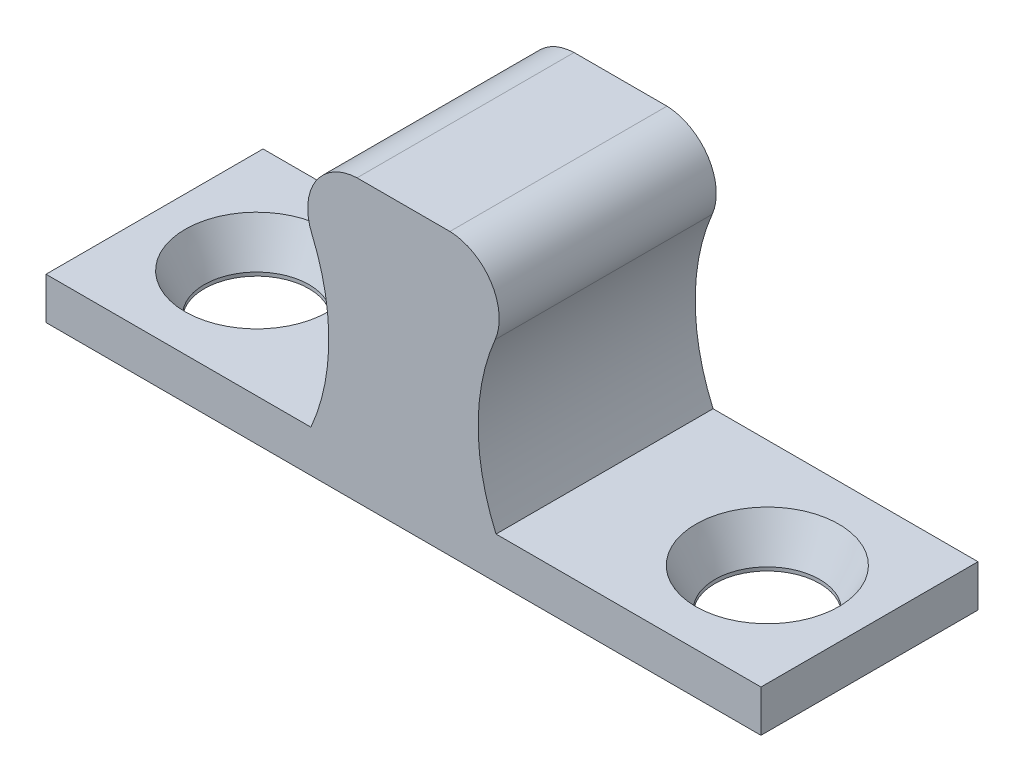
ISO-10303-21;
HEADER;
FILE_DESCRIPTION(('STEP AP214'),'2;1');
FILE_NAME('part.step','',(''),(''),'','','');
FILE_SCHEMA(('AUTOMOTIVE_DESIGN { 1 0 10303 214 1 1 1 1 }'));
ENDSEC;
DATA;
#1=APPLICATION_CONTEXT('core data for automotive mechanical design processes');
#2=APPLICATION_PROTOCOL_DEFINITION('international standard','automotive_design',2000,#1);
#3=PRODUCT_CONTEXT('',#1,'mechanical');
#4=PRODUCT('Part','Part','',(#3));
#5=PRODUCT_RELATED_PRODUCT_CATEGORY('part','',(#4));
#6=PRODUCT_DEFINITION_FORMATION('','',#4);
#7=PRODUCT_DEFINITION_CONTEXT('part definition',#1,'design');
#8=PRODUCT_DEFINITION('design','',#6,#7);
#9=PRODUCT_DEFINITION_SHAPE('','',#8);
#10=(LENGTH_UNIT() NAMED_UNIT(*) SI_UNIT(.MILLI.,.METRE.));
#11=(NAMED_UNIT(*) PLANE_ANGLE_UNIT() SI_UNIT($,.RADIAN.));
#12=(NAMED_UNIT(*) SI_UNIT($,.STERADIAN.) SOLID_ANGLE_UNIT());
#13=UNCERTAINTY_MEASURE_WITH_UNIT(LENGTH_MEASURE(1.E-05),#10,'distance_accuracy_value','');
#14=(GEOMETRIC_REPRESENTATION_CONTEXT(3) GLOBAL_UNCERTAINTY_ASSIGNED_CONTEXT((#13)) GLOBAL_UNIT_ASSIGNED_CONTEXT((#10,
#11,#12)) REPRESENTATION_CONTEXT('',''));
#15=CARTESIAN_POINT('',(0.,0.,0.));
#16=DIRECTION('',(0.,0.,1.));
#17=DIRECTION('',(1.,0.,0.));
#18=AXIS2_PLACEMENT_3D('',#15,#16,#17);
#19=CARTESIAN_POINT('',(11.1910280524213,4.96902977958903,0.));
#20=DIRECTION('',(0.,0.,1.));
#21=DIRECTION('',(1.,0.,0.));
#22=AXIS2_PLACEMENT_3D('',#19,#20,#21);
#23=CYLINDRICAL_SURFACE('',#22,8.26602805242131);
#24=DIRECTION('',(0.,0.,1.));
#25=VECTOR('',#24,1.);
#26=CARTESIAN_POINT('',(3.625,1.64,0.));
#27=LINE('',#26,#25);
#28=CARTESIAN_POINT('',(3.625,1.64,-4.25));
#29=VERTEX_POINT('',#28);
#30=CARTESIAN_POINT('',(3.625,1.64,4.25));
#31=VERTEX_POINT('',#30);
#32=EDGE_CURVE('E88',#29,#31,#27,.T.);
#33=ORIENTED_EDGE('',*,*,#32,.F.);
#34=CARTESIAN_POINT('',(11.1910280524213,4.96902977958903,-4.25));
#35=DIRECTION('',(0.,0.,1.));
#36=DIRECTION('',(1.,0.,0.));
#37=AXIS2_PLACEMENT_3D('',#34,#35,#36);
#38=CIRCLE('',#37,8.26602805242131);
#39=CARTESIAN_POINT('',(3.58927571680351,8.21565590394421,-4.25));
#40=VERTEX_POINT('',#39);
#41=EDGE_CURVE('E99',#29,#40,#38,.F.);
#42=ORIENTED_EDGE('',*,*,#41,.T.);
#43=DIRECTION('',(0.,0.,1.));
#44=VECTOR('',#43,1.);
#45=CARTESIAN_POINT('',(3.58927571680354,8.2156559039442,0.));
#46=LINE('',#45,#44);
#47=CARTESIAN_POINT('',(3.58927571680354,8.2156559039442,4.25));
#48=VERTEX_POINT('',#47);
#49=EDGE_CURVE('E93',#48,#40,#46,.F.);
#50=ORIENTED_EDGE('',*,*,#49,.F.);
#51=CARTESIAN_POINT('',(11.1910280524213,4.96902977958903,4.25));
#52=DIRECTION('',(0.,0.,1.));
#53=DIRECTION('',(1.,0.,0.));
#54=AXIS2_PLACEMENT_3D('',#51,#52,#53);
#55=CIRCLE('',#54,8.26602805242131);
#56=EDGE_CURVE('E96',#31,#48,#55,.F.);
#57=ORIENTED_EDGE('',*,*,#56,.F.);
#58=EDGE_LOOP('',(#33,#42,#50,#57));
#59=FACE_BOUND('',#58,.T.);
#60=ADVANCED_FACE('F15',(#59),#23,.F.);
#61=CARTESIAN_POINT('',(1.74999999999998,9.001190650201,0.));
#62=DIRECTION('',(0.,0.,1.));
#63=DIRECTION('',(1.,0.,0.));
#64=AXIS2_PLACEMENT_3D('',#61,#62,#63);
#65=CYLINDRICAL_SURFACE('',#64,2.);
#66=CARTESIAN_POINT('',(1.74999999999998,9.001190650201,-4.25));
#67=DIRECTION('',(0.,0.,1.));
#68=DIRECTION('',(1.,0.,0.));
#69=AXIS2_PLACEMENT_3D('',#66,#67,#68);
#70=CIRCLE('',#69,2.);
#71=CARTESIAN_POINT('',(1.81900132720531,11.,-4.25));
#72=VERTEX_POINT('',#71);
#73=EDGE_CURVE('E165',#40,#72,#70,.T.);
#74=ORIENTED_EDGE('',*,*,#73,.T.);
#75=DIRECTION('',(0.,0.,1.));
#76=VECTOR('',#75,1.);
#77=CARTESIAN_POINT('',(1.81900132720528,11.,0.));
#78=LINE('',#77,#76);
#79=CARTESIAN_POINT('',(1.81900132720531,11.,4.25));
#80=VERTEX_POINT('',#79);
#81=EDGE_CURVE('E102',#80,#72,#78,.F.);
#82=ORIENTED_EDGE('',*,*,#81,.F.);
#83=CARTESIAN_POINT('',(1.74999999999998,9.001190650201,4.25));
#84=DIRECTION('',(0.,0.,1.));
#85=DIRECTION('',(1.,0.,0.));
#86=AXIS2_PLACEMENT_3D('',#83,#84,#85);
#87=CIRCLE('',#86,2.);
#88=EDGE_CURVE('E105',#48,#80,#87,.T.);
#89=ORIENTED_EDGE('',*,*,#88,.F.);
#90=ORIENTED_EDGE('',*,*,#49,.T.);
#91=EDGE_LOOP('',(#74,#82,#89,#90));
#92=FACE_BOUND('',#91,.T.);
#93=ADVANCED_FACE('F106',(#92),#65,.T.);
#94=CARTESIAN_POINT('',(-1.81900132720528,11.,0.));
#95=DIRECTION('',(0.,1.,0.));
#96=DIRECTION('',(0.,0.,1.));
#97=AXIS2_PLACEMENT_3D('',#94,#95,#96);
#98=PLANE('',#97);
#99=DIRECTION('',(1.,0.,0.));
#100=VECTOR('',#99,1.);
#101=CARTESIAN_POINT('',(0.,11.,-4.25));
#102=LINE('',#101,#100);
#103=CARTESIAN_POINT('',(-1.8190013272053,11.,-4.25));
#104=VERTEX_POINT('',#103);
#105=EDGE_CURVE('E164',#72,#104,#102,.F.);
#106=ORIENTED_EDGE('',*,*,#105,.T.);
#107=DIRECTION('',(0.,0.,1.));
#108=VECTOR('',#107,1.);
#109=CARTESIAN_POINT('',(-1.81900132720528,11.,0.));
#110=LINE('',#109,#108);
#111=CARTESIAN_POINT('',(-1.8190013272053,11.,4.25));
#112=VERTEX_POINT('',#111);
#113=EDGE_CURVE('E181',#112,#104,#110,.F.);
#114=ORIENTED_EDGE('',*,*,#113,.F.);
#115=DIRECTION('',(1.,0.,0.));
#116=VECTOR('',#115,1.);
#117=CARTESIAN_POINT('',(0.,11.,4.25));
#118=LINE('',#117,#116);
#119=EDGE_CURVE('E111',#80,#112,#118,.F.);
#120=ORIENTED_EDGE('',*,*,#119,.F.);
#121=ORIENTED_EDGE('',*,*,#81,.T.);
#122=EDGE_LOOP('',(#106,#114,#120,#121));
#123=FACE_BOUND('',#122,.T.);
#124=ADVANCED_FACE('F185',(#123),#98,.T.);
#125=CARTESIAN_POINT('',(-1.75000000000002,9.001190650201,0.));
#126=DIRECTION('',(0.,0.,1.));
#127=DIRECTION('',(1.,0.,0.));
#128=AXIS2_PLACEMENT_3D('',#125,#126,#127);
#129=CYLINDRICAL_SURFACE('',#128,2.);
#130=CARTESIAN_POINT('',(-1.75000000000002,9.001190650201,-4.25));
#131=DIRECTION('',(0.,0.,1.));
#132=DIRECTION('',(1.,0.,0.));
#133=AXIS2_PLACEMENT_3D('',#130,#131,#132);
#134=CIRCLE('',#133,2.);
#135=CARTESIAN_POINT('',(-3.58927571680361,8.21565590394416,-4.25));
#136=VERTEX_POINT('',#135);
#137=EDGE_CURVE('E162',#104,#136,#134,.T.);
#138=ORIENTED_EDGE('',*,*,#137,.T.);
#139=DIRECTION('',(0.,0.,1.));
#140=VECTOR('',#139,1.);
#141=CARTESIAN_POINT('',(-3.58927571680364,8.21565590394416,0.));
#142=LINE('',#141,#140);
#143=CARTESIAN_POINT('',(-3.58927571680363,8.21565590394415,4.25));
#144=VERTEX_POINT('',#143);
#145=EDGE_CURVE('E130',#136,#144,#142,.T.);
#146=ORIENTED_EDGE('',*,*,#145,.T.);
#147=CARTESIAN_POINT('',(-1.75000000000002,9.001190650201,4.25));
#148=DIRECTION('',(0.,0.,1.));
#149=DIRECTION('',(1.,0.,0.));
#150=AXIS2_PLACEMENT_3D('',#147,#148,#149);
#151=CIRCLE('',#150,2.);
#152=EDGE_CURVE('E170',#112,#144,#151,.T.);
#153=ORIENTED_EDGE('',*,*,#152,.F.);
#154=ORIENTED_EDGE('',*,*,#113,.T.);
#155=EDGE_LOOP('',(#138,#146,#153,#154));
#156=FACE_BOUND('',#155,.T.);
#157=ADVANCED_FACE('F258',(#156),#129,.T.);
#158=CARTESIAN_POINT('',(-11.1910280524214,4.96902977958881,0.));
#159=DIRECTION('',(0.,0.,1.));
#160=DIRECTION('',(1.,0.,0.));
#161=AXIS2_PLACEMENT_3D('',#158,#159,#160);
#162=CYLINDRICAL_SURFACE('',#161,8.26602805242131);
#163=ORIENTED_EDGE('',*,*,#145,.F.);
#164=CARTESIAN_POINT('',(-11.1910280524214,4.96902977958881,-4.25));
#165=DIRECTION('',(0.,0.,1.));
#166=DIRECTION('',(1.,0.,0.));
#167=AXIS2_PLACEMENT_3D('',#164,#165,#166);
#168=CIRCLE('',#167,8.26602805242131);
#169=CARTESIAN_POINT('',(-3.625,1.64,-4.25));
#170=VERTEX_POINT('',#169);
#171=EDGE_CURVE('E159',#136,#170,#168,.F.);
#172=ORIENTED_EDGE('',*,*,#171,.T.);
#173=DIRECTION('',(0.,0.,1.));
#174=VECTOR('',#173,1.);
#175=CARTESIAN_POINT('',(-3.625,1.64,0.));
#176=LINE('',#175,#174);
#177=CARTESIAN_POINT('',(-3.625,1.64,4.25));
#178=VERTEX_POINT('',#177);
#179=EDGE_CURVE('E127',#178,#170,#176,.F.);
#180=ORIENTED_EDGE('',*,*,#179,.F.);
#181=CARTESIAN_POINT('',(-11.1910280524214,4.96902977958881,4.25));
#182=DIRECTION('',(0.,0.,1.));
#183=DIRECTION('',(1.,0.,0.));
#184=AXIS2_PLACEMENT_3D('',#181,#182,#183);
#185=CIRCLE('',#184,8.26602805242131);
#186=EDGE_CURVE('E169',#144,#178,#185,.F.);
#187=ORIENTED_EDGE('',*,*,#186,.F.);
#188=EDGE_LOOP('',(#163,#172,#180,#187));
#189=FACE_BOUND('',#188,.T.);
#190=ADVANCED_FACE('F255',(#189),#162,.F.);
#191=CARTESIAN_POINT('',(-14.,1.64,0.));
#192=DIRECTION('',(0.,1.,0.));
#193=DIRECTION('',(0.,0.,1.));
#194=AXIS2_PLACEMENT_3D('',#191,#192,#193);
#195=PLANE('',#194);
#196=CARTESIAN_POINT('',(-10.,1.6400000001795,0.));
#197=DIRECTION('',(0.,1.,0.));
#198=DIRECTION('',(0.,0.,1.));
#199=AXIS2_PLACEMENT_3D('',#196,#197,#198);
#200=CIRCLE('',#199,2.79999999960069);
#201=CARTESIAN_POINT('',(-10.,1.6400000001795,2.79999999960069));
#202=VERTEX_POINT('',#201);
#203=EDGE_CURVE('E18',#202,#202,#200,.F.);
#204=ORIENTED_EDGE('',*,*,#203,.T.);
#205=EDGE_LOOP('',(#204));
#206=FACE_BOUND('',#205,.T.);
#207=DIRECTION('',(1.,0.,0.));
#208=VECTOR('',#207,1.);
#209=CARTESIAN_POINT('',(0.,1.64,-4.25));
#210=LINE('',#209,#208);
#211=CARTESIAN_POINT('',(-14.,1.64,-4.25));
#212=VERTEX_POINT('',#211);
#213=EDGE_CURVE('E161',#170,#212,#210,.F.);
#214=ORIENTED_EDGE('',*,*,#213,.T.);
#215=DIRECTION('',(0.,0.,1.));
#216=VECTOR('',#215,1.);
#217=CARTESIAN_POINT('',(-14.,1.64,0.));
#218=LINE('',#217,#216);
#219=CARTESIAN_POINT('',(-14.,1.64,4.25));
#220=VERTEX_POINT('',#219);
#221=EDGE_CURVE('E143',#220,#212,#218,.F.);
#222=ORIENTED_EDGE('',*,*,#221,.F.);
#223=DIRECTION('',(1.,0.,0.));
#224=VECTOR('',#223,1.);
#225=CARTESIAN_POINT('',(0.,1.64,4.25));
#226=LINE('',#225,#224);
#227=EDGE_CURVE('E144',#178,#220,#226,.F.);
#228=ORIENTED_EDGE('',*,*,#227,.F.);
#229=ORIENTED_EDGE('',*,*,#179,.T.);
#230=EDGE_LOOP('',(#214,#222,#228,#229));
#231=FACE_BOUND('',#230,.T.);
#232=ADVANCED_FACE('F252',(#206,#231),#195,.T.);
#233=CARTESIAN_POINT('',(3.625,1.64,0.));
#234=DIRECTION('',(0.,1.,0.));
#235=DIRECTION('',(0.,0.,1.));
#236=AXIS2_PLACEMENT_3D('',#233,#234,#235);
#237=PLANE('',#236);
#238=CARTESIAN_POINT('',(10.,1.64000000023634,0.));
#239=DIRECTION('',(0.,1.,0.));
#240=DIRECTION('',(0.,0.,1.));
#241=AXIS2_PLACEMENT_3D('',#238,#239,#240);
#242=CIRCLE('',#241,2.79999999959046);
#243=CARTESIAN_POINT('',(10.,1.64000000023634,2.79999999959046));
#244=VERTEX_POINT('',#243);
#245=EDGE_CURVE('E118',#244,#244,#242,.F.);
#246=ORIENTED_EDGE('',*,*,#245,.T.);
#247=EDGE_LOOP('',(#246));
#248=FACE_BOUND('',#247,.T.);
#249=DIRECTION('',(1.,0.,0.));
#250=VECTOR('',#249,1.);
#251=CARTESIAN_POINT('',(0.,1.64,-4.25));
#252=LINE('',#251,#250);
#253=CARTESIAN_POINT('',(14.,1.64,-4.25));
#254=VERTEX_POINT('',#253);
#255=EDGE_CURVE('E168',#254,#29,#252,.F.);
#256=ORIENTED_EDGE('',*,*,#255,.T.);
#257=ORIENTED_EDGE('',*,*,#32,.T.);
#258=DIRECTION('',(1.,0.,0.));
#259=VECTOR('',#258,1.);
#260=CARTESIAN_POINT('',(0.,1.64,4.25));
#261=LINE('',#260,#259);
#262=CARTESIAN_POINT('',(14.,1.64,4.25));
#263=VERTEX_POINT('',#262);
#264=EDGE_CURVE('E116',#263,#31,#261,.F.);
#265=ORIENTED_EDGE('',*,*,#264,.F.);
#266=DIRECTION('',(0.,0.,-1.));
#267=VECTOR('',#266,1.);
#268=CARTESIAN_POINT('',(14.,1.64,0.));
#269=LINE('',#268,#267);
#270=EDGE_CURVE('E134',#254,#263,#269,.F.);
#271=ORIENTED_EDGE('',*,*,#270,.F.);
#272=EDGE_LOOP('',(#256,#257,#265,#271));
#273=FACE_BOUND('',#272,.T.);
#274=ADVANCED_FACE('F194',(#248,#273),#237,.T.);
#275=CARTESIAN_POINT('',(-10.,1.6400000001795,0.));
#276=DIRECTION('',(0.,1.,0.));
#277=DIRECTION('',(0.,0.,1.));
#278=AXIS2_PLACEMENT_3D('',#275,#276,#277);
#279=CONICAL_SURFACE('',#278,2.79999999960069,0.463647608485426);
#280=ORIENTED_EDGE('',*,*,#203,.F.);
#281=EDGE_LOOP('',(#280));
#282=FACE_BOUND('',#281,.T.);
#283=CARTESIAN_POINT('',(-10.,0.14,0.));
#284=DIRECTION('',(0.,-1.,0.));
#285=DIRECTION('',(0.,0.,-1.));
#286=AXIS2_PLACEMENT_3D('',#283,#284,#285);
#287=CIRCLE('',#286,2.05);
#288=CARTESIAN_POINT('',(-10.,0.14,-2.05));
#289=VERTEX_POINT('',#288);
#290=EDGE_CURVE('E137',#289,#289,#287,.T.);
#291=ORIENTED_EDGE('',*,*,#290,.T.);
#292=EDGE_LOOP('',(#291));
#293=FACE_BOUND('',#292,.T.);
#294=ADVANCED_FACE('F213',(#282,#293),#279,.F.);
#295=CARTESIAN_POINT('',(10.,1.64000000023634,0.));
#296=DIRECTION('',(0.,1.,0.));
#297=DIRECTION('',(0.,0.,1.));
#298=AXIS2_PLACEMENT_3D('',#295,#296,#297);
#299=CONICAL_SURFACE('',#298,2.79999999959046,0.463647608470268);
#300=ORIENTED_EDGE('',*,*,#245,.F.);
#301=EDGE_LOOP('',(#300));
#302=FACE_BOUND('',#301,.T.);
#303=CARTESIAN_POINT('',(10.,0.14,0.));
#304=DIRECTION('',(0.,-1.,0.));
#305=DIRECTION('',(0.,0.,-1.));
#306=AXIS2_PLACEMENT_3D('',#303,#304,#305);
#307=CIRCLE('',#306,2.05);
#308=CARTESIAN_POINT('',(10.,0.14,-2.05));
#309=VERTEX_POINT('',#308);
#310=EDGE_CURVE('E152',#309,#309,#307,.T.);
#311=ORIENTED_EDGE('',*,*,#310,.T.);
#312=EDGE_LOOP('',(#311));
#313=FACE_BOUND('',#312,.T.);
#314=ADVANCED_FACE('F243',(#302,#313),#299,.F.);
#315=CARTESIAN_POINT('',(0.,2.85954139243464,4.25));
#316=DIRECTION('',(0.,0.,1.));
#317=DIRECTION('',(1.,0.,0.));
#318=AXIS2_PLACEMENT_3D('',#315,#316,#317);
#319=PLANE('',#318);
#320=ORIENTED_EDGE('',*,*,#186,.T.);
#321=ORIENTED_EDGE('',*,*,#227,.T.);
#322=DIRECTION('',(0.,1.,0.));
#323=VECTOR('',#322,1.);
#324=CARTESIAN_POINT('',(-14.,0.,4.25));
#325=LINE('',#324,#323);
#326=CARTESIAN_POINT('',(-14.,0.,4.25));
#327=VERTEX_POINT('',#326);
#328=EDGE_CURVE('E140',#327,#220,#325,.T.);
#329=ORIENTED_EDGE('',*,*,#328,.F.);
#330=DIRECTION('',(1.,0.,0.));
#331=VECTOR('',#330,1.);
#332=CARTESIAN_POINT('',(0.,0.,4.25));
#333=LINE('',#332,#331);
#334=CARTESIAN_POINT('',(14.,0.,4.25));
#335=VERTEX_POINT('',#334);
#336=EDGE_CURVE('E149',#335,#327,#333,.F.);
#337=ORIENTED_EDGE('',*,*,#336,.F.);
#338=DIRECTION('',(0.,1.,0.));
#339=VECTOR('',#338,1.);
#340=CARTESIAN_POINT('',(14.,1.64,4.25));
#341=LINE('',#340,#339);
#342=EDGE_CURVE('E139',#263,#335,#341,.F.);
#343=ORIENTED_EDGE('',*,*,#342,.F.);
#344=ORIENTED_EDGE('',*,*,#264,.T.);
#345=ORIENTED_EDGE('',*,*,#56,.T.);
#346=ORIENTED_EDGE('',*,*,#88,.T.);
#347=ORIENTED_EDGE('',*,*,#119,.T.);
#348=ORIENTED_EDGE('',*,*,#152,.T.);
#349=EDGE_LOOP('',(#320,#321,#329,#337,#343,#344,#345,#346,#347,#348));
#350=FACE_BOUND('',#349,.T.);
#351=ADVANCED_FACE('F114',(#350),#319,.T.);
#352=CARTESIAN_POINT('',(-14.,0.,0.));
#353=DIRECTION('',(-1.,0.,0.));
#354=DIRECTION('',(0.,0.,1.));
#355=AXIS2_PLACEMENT_3D('',#352,#353,#354);
#356=PLANE('',#355);
#357=DIRECTION('',(0.,1.,0.));
#358=VECTOR('',#357,1.);
#359=CARTESIAN_POINT('',(-14.,2.85954139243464,-4.25));
#360=LINE('',#359,#358);
#361=CARTESIAN_POINT('',(-14.,0.,-4.25));
#362=VERTEX_POINT('',#361);
#363=EDGE_CURVE('E154',#212,#362,#360,.F.);
#364=ORIENTED_EDGE('',*,*,#363,.T.);
#365=DIRECTION('',(0.,0.,-1.));
#366=VECTOR('',#365,1.);
#367=CARTESIAN_POINT('',(-14.,0.,0.));
#368=LINE('',#367,#366);
#369=EDGE_CURVE('E145',#327,#362,#368,.T.);
#370=ORIENTED_EDGE('',*,*,#369,.F.);
#371=ORIENTED_EDGE('',*,*,#328,.T.);
#372=ORIENTED_EDGE('',*,*,#221,.T.);
#373=EDGE_LOOP('',(#364,#370,#371,#372));
#374=FACE_BOUND('',#373,.T.);
#375=ADVANCED_FACE('F237',(#374),#356,.T.);
#376=CARTESIAN_POINT('',(0.,2.85954139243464,-4.25));
#377=DIRECTION('',(0.,0.,1.));
#378=DIRECTION('',(1.,0.,0.));
#379=AXIS2_PLACEMENT_3D('',#376,#377,#378);
#380=PLANE('',#379);
#381=ORIENTED_EDGE('',*,*,#363,.F.);
#382=ORIENTED_EDGE('',*,*,#213,.F.);
#383=ORIENTED_EDGE('',*,*,#171,.F.);
#384=ORIENTED_EDGE('',*,*,#137,.F.);
#385=ORIENTED_EDGE('',*,*,#105,.F.);
#386=ORIENTED_EDGE('',*,*,#73,.F.);
#387=ORIENTED_EDGE('',*,*,#41,.F.);
#388=ORIENTED_EDGE('',*,*,#255,.F.);
#389=DIRECTION('',(0.,1.,0.));
#390=VECTOR('',#389,1.);
#391=CARTESIAN_POINT('',(14.,1.64,-4.25));
#392=LINE('',#391,#390);
#393=CARTESIAN_POINT('',(14.,0.,-4.25));
#394=VERTEX_POINT('',#393);
#395=EDGE_CURVE('E33',#394,#254,#392,.T.);
#396=ORIENTED_EDGE('',*,*,#395,.F.);
#397=DIRECTION('',(1.,0.,0.));
#398=VECTOR('',#397,1.);
#399=CARTESIAN_POINT('',(0.,0.,-4.25));
#400=LINE('',#399,#398);
#401=EDGE_CURVE('E148',#362,#394,#400,.T.);
#402=ORIENTED_EDGE('',*,*,#401,.F.);
#403=EDGE_LOOP('',(#381,#382,#383,#384,#385,#386,#387,#388,#396,#402));
#404=FACE_BOUND('',#403,.T.);
#405=ADVANCED_FACE('F188',(#404),#380,.F.);
#406=CARTESIAN_POINT('',(14.,1.64,0.));
#407=DIRECTION('',(1.,0.,0.));
#408=DIRECTION('',(0.,0.,-1.));
#409=AXIS2_PLACEMENT_3D('',#406,#407,#408);
#410=PLANE('',#409);
#411=ORIENTED_EDGE('',*,*,#395,.T.);
#412=ORIENTED_EDGE('',*,*,#270,.T.);
#413=ORIENTED_EDGE('',*,*,#342,.T.);
#414=DIRECTION('',(0.,0.,-1.));
#415=VECTOR('',#414,1.);
#416=CARTESIAN_POINT('',(14.,0.,0.));
#417=LINE('',#416,#415);
#418=EDGE_CURVE('E158',#394,#335,#417,.F.);
#419=ORIENTED_EDGE('',*,*,#418,.F.);
#420=EDGE_LOOP('',(#411,#412,#413,#419));
#421=FACE_BOUND('',#420,.T.);
#422=ADVANCED_FACE('F196',(#421),#410,.T.);
#423=CARTESIAN_POINT('',(-10.,1.64,0.));
#424=DIRECTION('',(0.,-1.,0.));
#425=DIRECTION('',(0.,0.,-1.));
#426=AXIS2_PLACEMENT_3D('',#423,#424,#425);
#427=CYLINDRICAL_SURFACE('',#426,2.05);
#428=ORIENTED_EDGE('',*,*,#290,.F.);
#429=EDGE_LOOP('',(#428));
#430=FACE_BOUND('',#429,.T.);
#431=CARTESIAN_POINT('',(-10.,0.,0.));
#432=DIRECTION('',(0.,-1.,0.));
#433=DIRECTION('',(0.,0.,-1.));
#434=AXIS2_PLACEMENT_3D('',#431,#432,#433);
#435=CIRCLE('',#434,2.05);
#436=CARTESIAN_POINT('',(-10.,0.,-2.05));
#437=VERTEX_POINT('',#436);
#438=EDGE_CURVE('E24',#437,#437,#435,.F.);
#439=ORIENTED_EDGE('',*,*,#438,.F.);
#440=EDGE_LOOP('',(#439));
#441=FACE_BOUND('',#440,.T.);
#442=ADVANCED_FACE('F215',(#430,#441),#427,.F.);
#443=CARTESIAN_POINT('',(10.,1.64,0.));
#444=DIRECTION('',(0.,-1.,0.));
#445=DIRECTION('',(0.,0.,-1.));
#446=AXIS2_PLACEMENT_3D('',#443,#444,#445);
#447=CYLINDRICAL_SURFACE('',#446,2.05);
#448=ORIENTED_EDGE('',*,*,#310,.F.);
#449=EDGE_LOOP('',(#448));
#450=FACE_BOUND('',#449,.T.);
#451=CARTESIAN_POINT('',(10.,0.,0.));
#452=DIRECTION('',(0.,-1.,0.));
#453=DIRECTION('',(0.,0.,-1.));
#454=AXIS2_PLACEMENT_3D('',#451,#452,#453);
#455=CIRCLE('',#454,2.05);
#456=CARTESIAN_POINT('',(10.,0.,-2.05));
#457=VERTEX_POINT('',#456);
#458=EDGE_CURVE('E10',#457,#457,#455,.F.);
#459=ORIENTED_EDGE('',*,*,#458,.F.);
#460=EDGE_LOOP('',(#459));
#461=FACE_BOUND('',#460,.T.);
#462=ADVANCED_FACE('F218',(#450,#461),#447,.F.);
#463=CARTESIAN_POINT('',(0.,0.,0.));
#464=DIRECTION('',(0.,-1.,0.));
#465=DIRECTION('',(0.,0.,-1.));
#466=AXIS2_PLACEMENT_3D('',#463,#464,#465);
#467=PLANE('',#466);
#468=ORIENTED_EDGE('',*,*,#458,.T.);
#469=EDGE_LOOP('',(#468));
#470=FACE_BOUND('',#469,.T.);
#471=ORIENTED_EDGE('',*,*,#438,.T.);
#472=EDGE_LOOP('',(#471));
#473=FACE_BOUND('',#472,.T.);
#474=ORIENTED_EDGE('',*,*,#401,.T.);
#475=ORIENTED_EDGE('',*,*,#418,.T.);
#476=ORIENTED_EDGE('',*,*,#336,.T.);
#477=ORIENTED_EDGE('',*,*,#369,.T.);
#478=EDGE_LOOP('',(#474,#475,#476,#477));
#479=FACE_BOUND('',#478,.T.);
#480=ADVANCED_FACE('F201',(#470,#473,#479),#467,.T.);
#481=CLOSED_SHELL('',(#60,#93,#124,#157,#190,#232,#274,#294,#314,#351,#375,#405,#422,#442,#462,#480));
#482=MANIFOLD_SOLID_BREP('B1',#481);
#483=ADVANCED_BREP_SHAPE_REPRESENTATION('',(#18,#482),#14);
#484=SHAPE_DEFINITION_REPRESENTATION(#9,#483);
ENDSEC;
END-ISO-10303-21;
